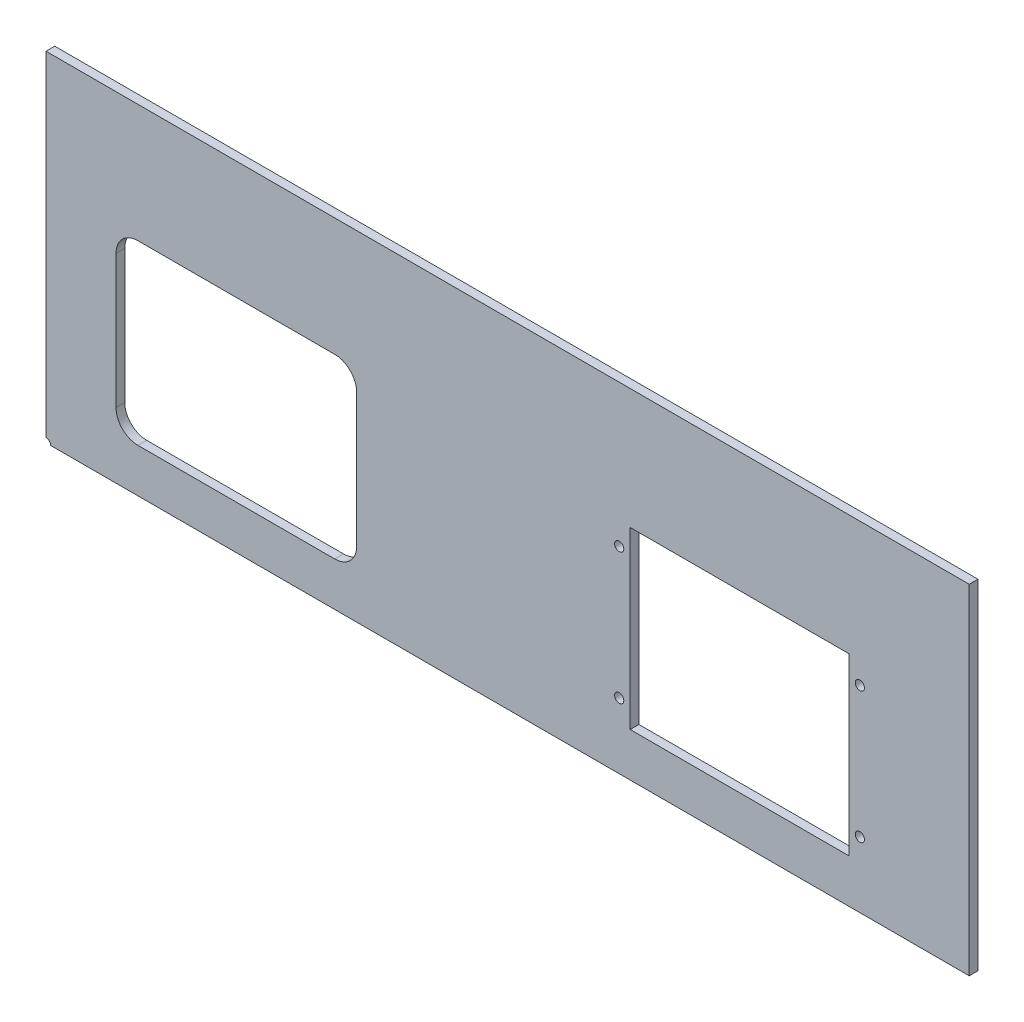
ISO-10303-21;
HEADER;
FILE_DESCRIPTION(('STEP AP214'),'2;1');
FILE_NAME('part.step','',(''),(''),'','','');
FILE_SCHEMA(('AUTOMOTIVE_DESIGN { 1 0 10303 214 1 1 1 1 }'));
ENDSEC;
DATA;
#1=APPLICATION_CONTEXT('core data for automotive mechanical design processes');
#2=APPLICATION_PROTOCOL_DEFINITION('international standard','automotive_design',2000,#1);
#3=PRODUCT_CONTEXT('',#1,'mechanical');
#4=PRODUCT('Part','Part','',(#3));
#5=PRODUCT_RELATED_PRODUCT_CATEGORY('part','',(#4));
#6=PRODUCT_DEFINITION_FORMATION('','',#4);
#7=PRODUCT_DEFINITION_CONTEXT('part definition',#1,'design');
#8=PRODUCT_DEFINITION('design','',#6,#7);
#9=PRODUCT_DEFINITION_SHAPE('','',#8);
#10=(LENGTH_UNIT() NAMED_UNIT(*) SI_UNIT(.MILLI.,.METRE.));
#11=(NAMED_UNIT(*) PLANE_ANGLE_UNIT() SI_UNIT($,.RADIAN.));
#12=(NAMED_UNIT(*) SI_UNIT($,.STERADIAN.) SOLID_ANGLE_UNIT());
#13=UNCERTAINTY_MEASURE_WITH_UNIT(LENGTH_MEASURE(1.E-05),#10,'distance_accuracy_value','');
#14=(GEOMETRIC_REPRESENTATION_CONTEXT(3) GLOBAL_UNCERTAINTY_ASSIGNED_CONTEXT((#13)) GLOBAL_UNIT_ASSIGNED_CONTEXT((#10,
#11,#12)) REPRESENTATION_CONTEXT('',''));
#15=CARTESIAN_POINT('',(0.,0.,0.));
#16=DIRECTION('',(0.,0.,1.));
#17=DIRECTION('',(1.,0.,0.));
#18=AXIS2_PLACEMENT_3D('',#15,#16,#17);
#19=CARTESIAN_POINT('',(0.,0.,4.));
#20=DIRECTION('',(1.,0.,0.));
#21=DIRECTION('',(0.,0.,-1.));
#22=AXIS2_PLACEMENT_3D('',#19,#20,#21);
#23=PLANE('',#22);
#24=DIRECTION('',(0.,-1.,0.));
#25=VECTOR('',#24,1.);
#26=CARTESIAN_POINT('',(0.,0.,0.));
#27=LINE('',#26,#25);
#28=CARTESIAN_POINT('',(0.,155.,0.));
#29=VERTEX_POINT('',#28);
#30=CARTESIAN_POINT('',(0.,2.09999999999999,0.));
#31=VERTEX_POINT('',#30);
#32=EDGE_CURVE('E281',#29,#31,#27,.T.);
#33=ORIENTED_EDGE('',*,*,#32,.T.);
#34=DIRECTION('',(0.,0.,1.));
#35=VECTOR('',#34,1.);
#36=CARTESIAN_POINT('',(0.,2.09999999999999,-128.062484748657));
#37=LINE('',#36,#35);
#38=CARTESIAN_POINT('',(0.,2.09999999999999,4.));
#39=VERTEX_POINT('',#38);
#40=EDGE_CURVE('E218',#31,#39,#37,.T.);
#41=ORIENTED_EDGE('',*,*,#40,.T.);
#42=DIRECTION('',(0.,-1.,0.));
#43=VECTOR('',#42,1.);
#44=CARTESIAN_POINT('',(0.,0.,4.));
#45=LINE('',#44,#43);
#46=CARTESIAN_POINT('',(0.,155.,4.));
#47=VERTEX_POINT('',#46);
#48=EDGE_CURVE('E303',#47,#39,#45,.T.);
#49=ORIENTED_EDGE('',*,*,#48,.F.);
#50=DIRECTION('',(0.,0.,-1.));
#51=VECTOR('',#50,1.);
#52=CARTESIAN_POINT('',(0.,155.,4.));
#53=LINE('',#52,#51);
#54=EDGE_CURVE('E396',#47,#29,#53,.T.);
#55=ORIENTED_EDGE('',*,*,#54,.T.);
#56=EDGE_LOOP('',(#33,#41,#49,#55));
#57=FACE_BOUND('',#56,.T.);
#58=ADVANCED_FACE('F48',(#57),#23,.F.);
#59=CARTESIAN_POINT('',(0.,0.,4.));
#60=DIRECTION('',(0.,1.,0.));
#61=DIRECTION('',(0.,0.,1.));
#62=AXIS2_PLACEMENT_3D('',#59,#60,#61);
#63=PLANE('',#62);
#64=DIRECTION('',(1.,0.,0.));
#65=VECTOR('',#64,1.);
#66=CARTESIAN_POINT('',(0.,0.,4.));
#67=LINE('',#66,#65);
#68=CARTESIAN_POINT('',(2.09999999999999,0.,4.));
#69=VERTEX_POINT('',#68);
#70=CARTESIAN_POINT('',(422.,0.,4.));
#71=VERTEX_POINT('',#70);
#72=EDGE_CURVE('E308',#69,#71,#67,.T.);
#73=ORIENTED_EDGE('',*,*,#72,.F.);
#74=DIRECTION('',(0.,0.,1.));
#75=VECTOR('',#74,1.);
#76=CARTESIAN_POINT('',(2.09999999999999,0.,-128.062484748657));
#77=LINE('',#76,#75);
#78=CARTESIAN_POINT('',(2.09999999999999,0.,0.));
#79=VERTEX_POINT('',#78);
#80=EDGE_CURVE('E214',#69,#79,#77,.F.);
#81=ORIENTED_EDGE('',*,*,#80,.T.);
#82=DIRECTION('',(1.,0.,0.));
#83=VECTOR('',#82,1.);
#84=CARTESIAN_POINT('',(0.,0.,0.));
#85=LINE('',#84,#83);
#86=CARTESIAN_POINT('',(422.,0.,0.));
#87=VERTEX_POINT('',#86);
#88=EDGE_CURVE('E406',#79,#87,#85,.T.);
#89=ORIENTED_EDGE('',*,*,#88,.T.);
#90=DIRECTION('',(0.,0.,-1.));
#91=VECTOR('',#90,1.);
#92=CARTESIAN_POINT('',(422.,0.,4.));
#93=LINE('',#92,#91);
#94=EDGE_CURVE('E12',#71,#87,#93,.T.);
#95=ORIENTED_EDGE('',*,*,#94,.F.);
#96=EDGE_LOOP('',(#73,#81,#89,#95));
#97=FACE_BOUND('',#96,.T.);
#98=ADVANCED_FACE('F427',(#97),#63,.F.);
#99=CARTESIAN_POINT('',(422.,0.,4.));
#100=DIRECTION('',(-1.,0.,0.));
#101=DIRECTION('',(0.,0.,1.));
#102=AXIS2_PLACEMENT_3D('',#99,#100,#101);
#103=PLANE('',#102);
#104=DIRECTION('',(0.,1.,0.));
#105=VECTOR('',#104,1.);
#106=CARTESIAN_POINT('',(422.,0.,0.));
#107=LINE('',#106,#105);
#108=CARTESIAN_POINT('',(422.,155.,0.));
#109=VERTEX_POINT('',#108);
#110=EDGE_CURVE('E674',#87,#109,#107,.T.);
#111=ORIENTED_EDGE('',*,*,#110,.T.);
#112=DIRECTION('',(0.,0.,-1.));
#113=VECTOR('',#112,1.);
#114=CARTESIAN_POINT('',(422.,155.,4.));
#115=LINE('',#114,#113);
#116=CARTESIAN_POINT('',(422.,155.,4.));
#117=VERTEX_POINT('',#116);
#118=EDGE_CURVE('E56',#117,#109,#115,.T.);
#119=ORIENTED_EDGE('',*,*,#118,.F.);
#120=DIRECTION('',(0.,1.,0.));
#121=VECTOR('',#120,1.);
#122=CARTESIAN_POINT('',(422.,0.,4.));
#123=LINE('',#122,#121);
#124=EDGE_CURVE('E681',#71,#117,#123,.T.);
#125=ORIENTED_EDGE('',*,*,#124,.F.);
#126=ORIENTED_EDGE('',*,*,#94,.T.);
#127=EDGE_LOOP('',(#111,#119,#125,#126));
#128=FACE_BOUND('',#127,.T.);
#129=ADVANCED_FACE('F432',(#128),#103,.F.);
#130=CARTESIAN_POINT('',(0.,155.,4.));
#131=DIRECTION('',(0.,-1.,0.));
#132=DIRECTION('',(0.,0.,-1.));
#133=AXIS2_PLACEMENT_3D('',#130,#131,#132);
#134=PLANE('',#133);
#135=DIRECTION('',(-1.,0.,0.));
#136=VECTOR('',#135,1.);
#137=CARTESIAN_POINT('',(0.,155.,0.));
#138=LINE('',#137,#136);
#139=EDGE_CURVE('E309',#109,#29,#138,.T.);
#140=ORIENTED_EDGE('',*,*,#139,.T.);
#141=ORIENTED_EDGE('',*,*,#54,.F.);
#142=DIRECTION('',(-1.,0.,0.));
#143=VECTOR('',#142,1.);
#144=CARTESIAN_POINT('',(0.,155.,4.));
#145=LINE('',#144,#143);
#146=EDGE_CURVE('E391',#117,#47,#145,.T.);
#147=ORIENTED_EDGE('',*,*,#146,.F.);
#148=ORIENTED_EDGE('',*,*,#118,.T.);
#149=EDGE_LOOP('',(#140,#141,#147,#148));
#150=FACE_BOUND('',#149,.T.);
#151=ADVANCED_FACE('F373',(#150),#134,.F.);
#152=CARTESIAN_POINT('',(0.,0.,4.));
#153=DIRECTION('',(0.,0.,-1.));
#154=DIRECTION('',(-1.,0.,0.));
#155=AXIS2_PLACEMENT_3D('',#152,#153,#154);
#156=PLANE('',#155);
#157=CARTESIAN_POINT('',(262.,30.,4.));
#158=DIRECTION('',(0.,0.,1.));
#159=DIRECTION('',(-1.,0.,0.));
#160=AXIS2_PLACEMENT_3D('',#157,#158,#159);
#161=CIRCLE('',#160,2.09999999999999);
#162=CARTESIAN_POINT('',(259.9,30.,4.));
#163=VERTEX_POINT('',#162);
#164=EDGE_CURVE('E355',#163,#163,#161,.T.);
#165=ORIENTED_EDGE('',*,*,#164,.F.);
#166=EDGE_LOOP('',(#165));
#167=FACE_BOUND('',#166,.T.);
#168=CARTESIAN_POINT('',(372.,30.,4.));
#169=DIRECTION('',(0.,0.,1.));
#170=DIRECTION('',(1.,0.,0.));
#171=AXIS2_PLACEMENT_3D('',#168,#169,#170);
#172=CIRCLE('',#171,2.09999999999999);
#173=CARTESIAN_POINT('',(374.1,30.,4.));
#174=VERTEX_POINT('',#173);
#175=EDGE_CURVE('E330',#174,#174,#172,.T.);
#176=ORIENTED_EDGE('',*,*,#175,.F.);
#177=EDGE_LOOP('',(#176));
#178=FACE_BOUND('',#177,.T.);
#179=CARTESIAN_POINT('',(372.,90.,4.));
#180=DIRECTION('',(0.,0.,1.));
#181=DIRECTION('',(1.,0.,0.));
#182=AXIS2_PLACEMENT_3D('',#179,#180,#181);
#183=CIRCLE('',#182,2.09999999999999);
#184=CARTESIAN_POINT('',(374.1,90.,4.));
#185=VERTEX_POINT('',#184);
#186=EDGE_CURVE('E329',#185,#185,#183,.T.);
#187=ORIENTED_EDGE('',*,*,#186,.F.);
#188=EDGE_LOOP('',(#187));
#189=FACE_BOUND('',#188,.T.);
#190=CARTESIAN_POINT('',(262.,90.,4.));
#191=DIRECTION('',(0.,0.,1.));
#192=DIRECTION('',(-1.,0.,0.));
#193=AXIS2_PLACEMENT_3D('',#190,#191,#192);
#194=CIRCLE('',#193,2.09999999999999);
#195=CARTESIAN_POINT('',(259.9,90.,4.));
#196=VERTEX_POINT('',#195);
#197=EDGE_CURVE('E344',#196,#196,#194,.T.);
#198=ORIENTED_EDGE('',*,*,#197,.F.);
#199=EDGE_LOOP('',(#198));
#200=FACE_BOUND('',#199,.T.);
#201=DIRECTION('',(0.,-1.,0.));
#202=VECTOR('',#201,1.);
#203=CARTESIAN_POINT('',(267.,20.,4.));
#204=LINE('',#203,#202);
#205=CARTESIAN_POINT('',(267.,100.,4.));
#206=VERTEX_POINT('',#205);
#207=CARTESIAN_POINT('',(267.,20.,4.));
#208=VERTEX_POINT('',#207);
#209=EDGE_CURVE('E195',#206,#208,#204,.T.);
#210=ORIENTED_EDGE('',*,*,#209,.F.);
#211=DIRECTION('',(-1.,0.,0.));
#212=VECTOR('',#211,1.);
#213=CARTESIAN_POINT('',(367.,100.,4.));
#214=LINE('',#213,#212);
#215=CARTESIAN_POINT('',(367.,100.,4.));
#216=VERTEX_POINT('',#215);
#217=EDGE_CURVE('E185',#216,#206,#214,.T.);
#218=ORIENTED_EDGE('',*,*,#217,.F.);
#219=DIRECTION('',(0.,1.,0.));
#220=VECTOR('',#219,1.);
#221=CARTESIAN_POINT('',(367.,20.,4.));
#222=LINE('',#221,#220);
#223=CARTESIAN_POINT('',(367.,20.,4.));
#224=VERTEX_POINT('',#223);
#225=EDGE_CURVE('E199',#224,#216,#222,.T.);
#226=ORIENTED_EDGE('',*,*,#225,.F.);
#227=DIRECTION('',(1.,0.,0.));
#228=VECTOR('',#227,1.);
#229=CARTESIAN_POINT('',(367.,20.,4.));
#230=LINE('',#229,#228);
#231=EDGE_CURVE('E63',#208,#224,#230,.T.);
#232=ORIENTED_EDGE('',*,*,#231,.F.);
#233=EDGE_LOOP('',(#210,#218,#226,#232));
#234=FACE_BOUND('',#233,.T.);
#235=DIRECTION('',(0.,-1.,0.));
#236=VECTOR('',#235,1.);
#237=CARTESIAN_POINT('',(32.,91.,4.));
#238=LINE('',#237,#236);
#239=CARTESIAN_POINT('',(32.,91.,4.));
#240=VERTEX_POINT('',#239);
#241=CARTESIAN_POINT('',(32.,30.,4.));
#242=VERTEX_POINT('',#241);
#243=EDGE_CURVE('E260',#240,#242,#238,.T.);
#244=ORIENTED_EDGE('',*,*,#243,.F.);
#245=CARTESIAN_POINT('',(42.,91.,4.));
#246=DIRECTION('',(0.,0.,1.));
#247=DIRECTION('',(1.,0.,0.));
#248=AXIS2_PLACEMENT_3D('',#245,#246,#247);
#249=CIRCLE('',#248,10.);
#250=CARTESIAN_POINT('',(42.,101.,4.));
#251=VERTEX_POINT('',#250);
#252=EDGE_CURVE('E222',#251,#240,#249,.T.);
#253=ORIENTED_EDGE('',*,*,#252,.F.);
#254=DIRECTION('',(-1.,0.,0.));
#255=VECTOR('',#254,1.);
#256=CARTESIAN_POINT('',(42.,101.,4.));
#257=LINE('',#256,#255);
#258=CARTESIAN_POINT('',(132.,101.,4.));
#259=VERTEX_POINT('',#258);
#260=EDGE_CURVE('E228',#259,#251,#257,.T.);
#261=ORIENTED_EDGE('',*,*,#260,.F.);
#262=CARTESIAN_POINT('',(132.,91.,4.));
#263=DIRECTION('',(0.,0.,1.));
#264=DIRECTION('',(1.,0.,0.));
#265=AXIS2_PLACEMENT_3D('',#262,#263,#264);
#266=CIRCLE('',#265,10.);
#267=CARTESIAN_POINT('',(142.,91.,4.));
#268=VERTEX_POINT('',#267);
#269=EDGE_CURVE('E275',#268,#259,#266,.T.);
#270=ORIENTED_EDGE('',*,*,#269,.F.);
#271=DIRECTION('',(0.,1.,0.));
#272=VECTOR('',#271,1.);
#273=CARTESIAN_POINT('',(142.,91.,4.));
#274=LINE('',#273,#272);
#275=CARTESIAN_POINT('',(142.,30.,4.));
#276=VERTEX_POINT('',#275);
#277=EDGE_CURVE('E647',#276,#268,#274,.T.);
#278=ORIENTED_EDGE('',*,*,#277,.F.);
#279=CARTESIAN_POINT('',(132.,30.,4.));
#280=DIRECTION('',(0.,0.,1.));
#281=DIRECTION('',(-1.,0.,0.));
#282=AXIS2_PLACEMENT_3D('',#279,#280,#281);
#283=CIRCLE('',#282,10.);
#284=CARTESIAN_POINT('',(132.,20.,4.));
#285=VERTEX_POINT('',#284);
#286=EDGE_CURVE('E649',#285,#276,#283,.T.);
#287=ORIENTED_EDGE('',*,*,#286,.F.);
#288=DIRECTION('',(1.,0.,0.));
#289=VECTOR('',#288,1.);
#290=CARTESIAN_POINT('',(42.,20.,4.));
#291=LINE('',#290,#289);
#292=CARTESIAN_POINT('',(42.,20.,4.));
#293=VERTEX_POINT('',#292);
#294=EDGE_CURVE('E652',#293,#285,#291,.T.);
#295=ORIENTED_EDGE('',*,*,#294,.F.);
#296=CARTESIAN_POINT('',(42.,30.,4.));
#297=DIRECTION('',(0.,0.,1.));
#298=DIRECTION('',(-1.,0.,0.));
#299=AXIS2_PLACEMENT_3D('',#296,#297,#298);
#300=CIRCLE('',#299,10.);
#301=EDGE_CURVE('E661',#242,#293,#300,.T.);
#302=ORIENTED_EDGE('',*,*,#301,.F.);
#303=EDGE_LOOP('',(#244,#253,#261,#270,#278,#287,#295,#302));
#304=FACE_BOUND('',#303,.T.);
#305=ORIENTED_EDGE('',*,*,#48,.T.);
#306=CARTESIAN_POINT('',(0.,0.,4.));
#307=DIRECTION('',(0.,0.,1.));
#308=DIRECTION('',(1.,0.,0.));
#309=AXIS2_PLACEMENT_3D('',#306,#307,#308);
#310=CIRCLE('',#309,2.09999999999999);
#311=EDGE_CURVE('E318',#69,#39,#310,.T.);
#312=ORIENTED_EDGE('',*,*,#311,.F.);
#313=ORIENTED_EDGE('',*,*,#72,.T.);
#314=ORIENTED_EDGE('',*,*,#124,.T.);
#315=ORIENTED_EDGE('',*,*,#146,.T.);
#316=EDGE_LOOP('',(#305,#312,#313,#314,#315));
#317=FACE_BOUND('',#316,.T.);
#318=ADVANCED_FACE('F370',(#167,#178,#189,#200,#234,#304,#317),#156,.F.);
#319=CARTESIAN_POINT('',(0.,0.,0.));
#320=DIRECTION('',(0.,0.,-1.));
#321=DIRECTION('',(-1.,0.,0.));
#322=AXIS2_PLACEMENT_3D('',#319,#320,#321);
#323=PLANE('',#322);
#324=CARTESIAN_POINT('',(262.,30.,0.));
#325=DIRECTION('',(0.,0.,-1.));
#326=DIRECTION('',(-1.,0.,0.));
#327=AXIS2_PLACEMENT_3D('',#324,#325,#326);
#328=CIRCLE('',#327,2.09999999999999);
#329=CARTESIAN_POINT('',(259.9,30.,0.));
#330=VERTEX_POINT('',#329);
#331=EDGE_CURVE('E350',#330,#330,#328,.F.);
#332=ORIENTED_EDGE('',*,*,#331,.T.);
#333=EDGE_LOOP('',(#332));
#334=FACE_BOUND('',#333,.T.);
#335=CARTESIAN_POINT('',(372.,30.,0.));
#336=DIRECTION('',(0.,0.,-1.));
#337=DIRECTION('',(-1.,0.,0.));
#338=AXIS2_PLACEMENT_3D('',#335,#336,#337);
#339=CIRCLE('',#338,2.09999999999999);
#340=CARTESIAN_POINT('',(369.9,30.,0.));
#341=VERTEX_POINT('',#340);
#342=EDGE_CURVE('E352',#341,#341,#339,.F.);
#343=ORIENTED_EDGE('',*,*,#342,.T.);
#344=EDGE_LOOP('',(#343));
#345=FACE_BOUND('',#344,.T.);
#346=CARTESIAN_POINT('',(372.,90.,0.));
#347=DIRECTION('',(0.,0.,-1.));
#348=DIRECTION('',(-1.,0.,0.));
#349=AXIS2_PLACEMENT_3D('',#346,#347,#348);
#350=CIRCLE('',#349,2.09999999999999);
#351=CARTESIAN_POINT('',(369.9,90.,0.));
#352=VERTEX_POINT('',#351);
#353=EDGE_CURVE('E325',#352,#352,#350,.F.);
#354=ORIENTED_EDGE('',*,*,#353,.T.);
#355=EDGE_LOOP('',(#354));
#356=FACE_BOUND('',#355,.T.);
#357=CARTESIAN_POINT('',(0.,0.,0.));
#358=DIRECTION('',(0.,0.,-1.));
#359=DIRECTION('',(-1.,0.,0.));
#360=AXIS2_PLACEMENT_3D('',#357,#358,#359);
#361=CIRCLE('',#360,2.09999999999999);
#362=EDGE_CURVE('E323',#79,#31,#361,.F.);
#363=ORIENTED_EDGE('',*,*,#362,.T.);
#364=ORIENTED_EDGE('',*,*,#32,.F.);
#365=ORIENTED_EDGE('',*,*,#139,.F.);
#366=ORIENTED_EDGE('',*,*,#110,.F.);
#367=ORIENTED_EDGE('',*,*,#88,.F.);
#368=EDGE_LOOP('',(#363,#364,#365,#366,#367));
#369=FACE_BOUND('',#368,.T.);
#370=CARTESIAN_POINT('',(262.,90.,0.));
#371=DIRECTION('',(0.,0.,-1.));
#372=DIRECTION('',(-1.,0.,0.));
#373=AXIS2_PLACEMENT_3D('',#370,#371,#372);
#374=CIRCLE('',#373,2.09999999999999);
#375=CARTESIAN_POINT('',(259.9,90.,0.));
#376=VERTEX_POINT('',#375);
#377=EDGE_CURVE('E351',#376,#376,#374,.F.);
#378=ORIENTED_EDGE('',*,*,#377,.T.);
#379=EDGE_LOOP('',(#378));
#380=FACE_BOUND('',#379,.T.);
#381=DIRECTION('',(-1.,0.,0.));
#382=VECTOR('',#381,1.);
#383=CARTESIAN_POINT('',(367.,100.,0.));
#384=LINE('',#383,#382);
#385=CARTESIAN_POINT('',(367.,100.,0.));
#386=VERTEX_POINT('',#385);
#387=CARTESIAN_POINT('',(267.,100.,0.));
#388=VERTEX_POINT('',#387);
#389=EDGE_CURVE('E182',#386,#388,#384,.T.);
#390=ORIENTED_EDGE('',*,*,#389,.T.);
#391=DIRECTION('',(0.,-1.,0.));
#392=VECTOR('',#391,1.);
#393=CARTESIAN_POINT('',(267.,20.,0.));
#394=LINE('',#393,#392);
#395=CARTESIAN_POINT('',(267.,20.,0.));
#396=VERTEX_POINT('',#395);
#397=EDGE_CURVE('E168',#388,#396,#394,.T.);
#398=ORIENTED_EDGE('',*,*,#397,.T.);
#399=DIRECTION('',(1.,0.,0.));
#400=VECTOR('',#399,1.);
#401=CARTESIAN_POINT('',(367.,20.,0.));
#402=LINE('',#401,#400);
#403=CARTESIAN_POINT('',(367.,20.,0.));
#404=VERTEX_POINT('',#403);
#405=EDGE_CURVE('E205',#396,#404,#402,.T.);
#406=ORIENTED_EDGE('',*,*,#405,.T.);
#407=DIRECTION('',(0.,1.,0.));
#408=VECTOR('',#407,1.);
#409=CARTESIAN_POINT('',(367.,20.,0.));
#410=LINE('',#409,#408);
#411=EDGE_CURVE('E191',#404,#386,#410,.T.);
#412=ORIENTED_EDGE('',*,*,#411,.T.);
#413=EDGE_LOOP('',(#390,#398,#406,#412));
#414=FACE_BOUND('',#413,.T.);
#415=CARTESIAN_POINT('',(42.,91.,0.));
#416=DIRECTION('',(0.,0.,1.));
#417=DIRECTION('',(1.,0.,0.));
#418=AXIS2_PLACEMENT_3D('',#415,#416,#417);
#419=CIRCLE('',#418,10.);
#420=CARTESIAN_POINT('',(42.,101.,0.));
#421=VERTEX_POINT('',#420);
#422=CARTESIAN_POINT('',(32.,91.,0.));
#423=VERTEX_POINT('',#422);
#424=EDGE_CURVE('E223',#421,#423,#419,.T.);
#425=ORIENTED_EDGE('',*,*,#424,.T.);
#426=DIRECTION('',(0.,-1.,0.));
#427=VECTOR('',#426,1.);
#428=CARTESIAN_POINT('',(32.,91.,0.));
#429=LINE('',#428,#427);
#430=CARTESIAN_POINT('',(32.,30.,0.));
#431=VERTEX_POINT('',#430);
#432=EDGE_CURVE('E227',#423,#431,#429,.T.);
#433=ORIENTED_EDGE('',*,*,#432,.T.);
#434=CARTESIAN_POINT('',(42.,30.,0.));
#435=DIRECTION('',(0.,0.,1.));
#436=DIRECTION('',(-1.,0.,0.));
#437=AXIS2_PLACEMENT_3D('',#434,#435,#436);
#438=CIRCLE('',#437,10.);
#439=CARTESIAN_POINT('',(42.,20.,0.));
#440=VERTEX_POINT('',#439);
#441=EDGE_CURVE('E232',#431,#440,#438,.T.);
#442=ORIENTED_EDGE('',*,*,#441,.T.);
#443=DIRECTION('',(1.,0.,0.));
#444=VECTOR('',#443,1.);
#445=CARTESIAN_POINT('',(42.,20.,0.));
#446=LINE('',#445,#444);
#447=CARTESIAN_POINT('',(132.,20.,0.));
#448=VERTEX_POINT('',#447);
#449=EDGE_CURVE('E236',#440,#448,#446,.T.);
#450=ORIENTED_EDGE('',*,*,#449,.T.);
#451=CARTESIAN_POINT('',(132.,30.,0.));
#452=DIRECTION('',(0.,0.,1.));
#453=DIRECTION('',(-1.,0.,0.));
#454=AXIS2_PLACEMENT_3D('',#451,#452,#453);
#455=CIRCLE('',#454,10.);
#456=CARTESIAN_POINT('',(142.,30.,0.));
#457=VERTEX_POINT('',#456);
#458=EDGE_CURVE('E240',#448,#457,#455,.T.);
#459=ORIENTED_EDGE('',*,*,#458,.T.);
#460=DIRECTION('',(0.,1.,0.));
#461=VECTOR('',#460,1.);
#462=CARTESIAN_POINT('',(142.,91.,0.));
#463=LINE('',#462,#461);
#464=CARTESIAN_POINT('',(142.,91.,0.));
#465=VERTEX_POINT('',#464);
#466=EDGE_CURVE('E244',#457,#465,#463,.T.);
#467=ORIENTED_EDGE('',*,*,#466,.T.);
#468=CARTESIAN_POINT('',(132.,91.,0.));
#469=DIRECTION('',(0.,0.,1.));
#470=DIRECTION('',(1.,0.,0.));
#471=AXIS2_PLACEMENT_3D('',#468,#469,#470);
#472=CIRCLE('',#471,10.);
#473=CARTESIAN_POINT('',(132.,101.,0.));
#474=VERTEX_POINT('',#473);
#475=EDGE_CURVE('E248',#465,#474,#472,.T.);
#476=ORIENTED_EDGE('',*,*,#475,.T.);
#477=DIRECTION('',(-1.,0.,0.));
#478=VECTOR('',#477,1.);
#479=CARTESIAN_POINT('',(42.,101.,0.));
#480=LINE('',#479,#478);
#481=EDGE_CURVE('E252',#474,#421,#480,.T.);
#482=ORIENTED_EDGE('',*,*,#481,.T.);
#483=EDGE_LOOP('',(#425,#433,#442,#450,#459,#467,#476,#482));
#484=FACE_BOUND('',#483,.T.);
#485=ADVANCED_FACE('F189',(#334,#345,#356,#369,#380,#414,#484),#323,.T.);
#486=CARTESIAN_POINT('',(42.,91.,0.));
#487=DIRECTION('',(0.,0.,1.));
#488=DIRECTION('',(1.,0.,0.));
#489=AXIS2_PLACEMENT_3D('',#486,#487,#488);
#490=CYLINDRICAL_SURFACE('',#489,10.);
#491=ORIENTED_EDGE('',*,*,#252,.T.);
#492=DIRECTION('',(0.,0.,1.));
#493=VECTOR('',#492,1.);
#494=CARTESIAN_POINT('',(32.,91.,0.));
#495=LINE('',#494,#493);
#496=EDGE_CURVE('E256',#423,#240,#495,.T.);
#497=ORIENTED_EDGE('',*,*,#496,.F.);
#498=ORIENTED_EDGE('',*,*,#424,.F.);
#499=DIRECTION('',(0.,0.,1.));
#500=VECTOR('',#499,1.);
#501=CARTESIAN_POINT('',(42.,101.,0.));
#502=LINE('',#501,#500);
#503=EDGE_CURVE('E278',#421,#251,#502,.T.);
#504=ORIENTED_EDGE('',*,*,#503,.T.);
#505=EDGE_LOOP('',(#491,#497,#498,#504));
#506=FACE_BOUND('',#505,.T.);
#507=ADVANCED_FACE('F444',(#506),#490,.F.);
#508=CARTESIAN_POINT('',(42.,101.,0.));
#509=DIRECTION('',(0.,1.,0.));
#510=DIRECTION('',(0.,0.,1.));
#511=AXIS2_PLACEMENT_3D('',#508,#509,#510);
#512=PLANE('',#511);
#513=ORIENTED_EDGE('',*,*,#260,.T.);
#514=ORIENTED_EDGE('',*,*,#503,.F.);
#515=ORIENTED_EDGE('',*,*,#481,.F.);
#516=DIRECTION('',(0.,0.,1.));
#517=VECTOR('',#516,1.);
#518=CARTESIAN_POINT('',(132.,101.,0.));
#519=LINE('',#518,#517);
#520=EDGE_CURVE('E282',#474,#259,#519,.T.);
#521=ORIENTED_EDGE('',*,*,#520,.T.);
#522=EDGE_LOOP('',(#513,#514,#515,#521));
#523=FACE_BOUND('',#522,.T.);
#524=ADVANCED_FACE('F449',(#523),#512,.F.);
#525=CARTESIAN_POINT('',(132.,91.,0.));
#526=DIRECTION('',(0.,0.,1.));
#527=DIRECTION('',(1.,0.,0.));
#528=AXIS2_PLACEMENT_3D('',#525,#526,#527);
#529=CYLINDRICAL_SURFACE('',#528,10.);
#530=ORIENTED_EDGE('',*,*,#269,.T.);
#531=ORIENTED_EDGE('',*,*,#520,.F.);
#532=ORIENTED_EDGE('',*,*,#475,.F.);
#533=DIRECTION('',(0.,0.,1.));
#534=VECTOR('',#533,1.);
#535=CARTESIAN_POINT('',(142.,91.,0.));
#536=LINE('',#535,#534);
#537=EDGE_CURVE('E285',#465,#268,#536,.T.);
#538=ORIENTED_EDGE('',*,*,#537,.T.);
#539=EDGE_LOOP('',(#530,#531,#532,#538));
#540=FACE_BOUND('',#539,.T.);
#541=ADVANCED_FACE('F469',(#540),#529,.F.);
#542=CARTESIAN_POINT('',(142.,91.,0.));
#543=DIRECTION('',(1.,0.,0.));
#544=DIRECTION('',(0.,0.,-1.));
#545=AXIS2_PLACEMENT_3D('',#542,#543,#544);
#546=PLANE('',#545);
#547=ORIENTED_EDGE('',*,*,#277,.T.);
#548=ORIENTED_EDGE('',*,*,#537,.F.);
#549=ORIENTED_EDGE('',*,*,#466,.F.);
#550=DIRECTION('',(0.,0.,1.));
#551=VECTOR('',#550,1.);
#552=CARTESIAN_POINT('',(142.,30.,0.));
#553=LINE('',#552,#551);
#554=EDGE_CURVE('E288',#457,#276,#553,.T.);
#555=ORIENTED_EDGE('',*,*,#554,.T.);
#556=EDGE_LOOP('',(#547,#548,#549,#555));
#557=FACE_BOUND('',#556,.T.);
#558=ADVANCED_FACE('F465',(#557),#546,.F.);
#559=CARTESIAN_POINT('',(132.,30.,0.));
#560=DIRECTION('',(0.,0.,1.));
#561=DIRECTION('',(1.,0.,0.));
#562=AXIS2_PLACEMENT_3D('',#559,#560,#561);
#563=CYLINDRICAL_SURFACE('',#562,10.);
#564=ORIENTED_EDGE('',*,*,#286,.T.);
#565=ORIENTED_EDGE('',*,*,#554,.F.);
#566=ORIENTED_EDGE('',*,*,#458,.F.);
#567=DIRECTION('',(0.,0.,1.));
#568=VECTOR('',#567,1.);
#569=CARTESIAN_POINT('',(132.,20.,0.));
#570=LINE('',#569,#568);
#571=EDGE_CURVE('E291',#448,#285,#570,.T.);
#572=ORIENTED_EDGE('',*,*,#571,.T.);
#573=EDGE_LOOP('',(#564,#565,#566,#572));
#574=FACE_BOUND('',#573,.T.);
#575=ADVANCED_FACE('F461',(#574),#563,.F.);
#576=CARTESIAN_POINT('',(42.,20.,0.));
#577=DIRECTION('',(0.,-1.,0.));
#578=DIRECTION('',(0.,0.,-1.));
#579=AXIS2_PLACEMENT_3D('',#576,#577,#578);
#580=PLANE('',#579);
#581=ORIENTED_EDGE('',*,*,#294,.T.);
#582=ORIENTED_EDGE('',*,*,#571,.F.);
#583=ORIENTED_EDGE('',*,*,#449,.F.);
#584=DIRECTION('',(0.,0.,1.));
#585=VECTOR('',#584,1.);
#586=CARTESIAN_POINT('',(42.,20.,0.));
#587=LINE('',#586,#585);
#588=EDGE_CURVE('E294',#440,#293,#587,.T.);
#589=ORIENTED_EDGE('',*,*,#588,.T.);
#590=EDGE_LOOP('',(#581,#582,#583,#589));
#591=FACE_BOUND('',#590,.T.);
#592=ADVANCED_FACE('F457',(#591),#580,.F.);
#593=CARTESIAN_POINT('',(42.,30.,0.));
#594=DIRECTION('',(0.,0.,1.));
#595=DIRECTION('',(1.,0.,0.));
#596=AXIS2_PLACEMENT_3D('',#593,#594,#595);
#597=CYLINDRICAL_SURFACE('',#596,10.);
#598=ORIENTED_EDGE('',*,*,#301,.T.);
#599=ORIENTED_EDGE('',*,*,#588,.F.);
#600=ORIENTED_EDGE('',*,*,#441,.F.);
#601=DIRECTION('',(0.,0.,1.));
#602=VECTOR('',#601,1.);
#603=CARTESIAN_POINT('',(32.,30.,0.));
#604=LINE('',#603,#602);
#605=EDGE_CURVE('E297',#431,#242,#604,.T.);
#606=ORIENTED_EDGE('',*,*,#605,.T.);
#607=EDGE_LOOP('',(#598,#599,#600,#606));
#608=FACE_BOUND('',#607,.T.);
#609=ADVANCED_FACE('F453',(#608),#597,.F.);
#610=CARTESIAN_POINT('',(32.,91.,0.));
#611=DIRECTION('',(-1.,0.,0.));
#612=DIRECTION('',(0.,-1.,0.));
#613=AXIS2_PLACEMENT_3D('',#610,#611,#612);
#614=PLANE('',#613);
#615=ORIENTED_EDGE('',*,*,#243,.T.);
#616=ORIENTED_EDGE('',*,*,#605,.F.);
#617=ORIENTED_EDGE('',*,*,#432,.F.);
#618=ORIENTED_EDGE('',*,*,#496,.T.);
#619=EDGE_LOOP('',(#615,#616,#617,#618));
#620=FACE_BOUND('',#619,.T.);
#621=ADVANCED_FACE('F451',(#620),#614,.F.);
#622=CARTESIAN_POINT('',(367.,100.,-128.062484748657));
#623=DIRECTION('',(0.,1.,0.));
#624=DIRECTION('',(-1.,0.,0.));
#625=AXIS2_PLACEMENT_3D('',#622,#623,#624);
#626=PLANE('',#625);
#627=DIRECTION('',(0.,0.,1.));
#628=VECTOR('',#627,1.);
#629=CARTESIAN_POINT('',(367.,100.,-128.062484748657));
#630=LINE('',#629,#628);
#631=EDGE_CURVE('E71',#386,#216,#630,.T.);
#632=ORIENTED_EDGE('',*,*,#631,.T.);
#633=ORIENTED_EDGE('',*,*,#217,.T.);
#634=DIRECTION('',(0.,0.,1.));
#635=VECTOR('',#634,1.);
#636=CARTESIAN_POINT('',(267.,100.,-128.062484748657));
#637=LINE('',#636,#635);
#638=EDGE_CURVE('E172',#388,#206,#637,.T.);
#639=ORIENTED_EDGE('',*,*,#638,.F.);
#640=ORIENTED_EDGE('',*,*,#389,.F.);
#641=EDGE_LOOP('',(#632,#633,#639,#640));
#642=FACE_BOUND('',#641,.T.);
#643=ADVANCED_FACE('F181',(#642),#626,.F.);
#644=CARTESIAN_POINT('',(267.,20.,-128.062484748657));
#645=DIRECTION('',(-1.,0.,0.));
#646=DIRECTION('',(0.,0.,1.));
#647=AXIS2_PLACEMENT_3D('',#644,#645,#646);
#648=PLANE('',#647);
#649=ORIENTED_EDGE('',*,*,#638,.T.);
#650=ORIENTED_EDGE('',*,*,#209,.T.);
#651=DIRECTION('',(0.,0.,1.));
#652=VECTOR('',#651,1.);
#653=CARTESIAN_POINT('',(267.,20.,-128.062484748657));
#654=LINE('',#653,#652);
#655=EDGE_CURVE('E174',#396,#208,#654,.T.);
#656=ORIENTED_EDGE('',*,*,#655,.F.);
#657=ORIENTED_EDGE('',*,*,#397,.F.);
#658=EDGE_LOOP('',(#649,#650,#656,#657));
#659=FACE_BOUND('',#658,.T.);
#660=ADVANCED_FACE('F170',(#659),#648,.F.);
#661=CARTESIAN_POINT('',(367.,20.,-128.062484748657));
#662=DIRECTION('',(0.,-1.,0.));
#663=DIRECTION('',(1.,0.,0.));
#664=AXIS2_PLACEMENT_3D('',#661,#662,#663);
#665=PLANE('',#664);
#666=ORIENTED_EDGE('',*,*,#655,.T.);
#667=ORIENTED_EDGE('',*,*,#231,.T.);
#668=DIRECTION('',(0.,0.,1.));
#669=VECTOR('',#668,1.);
#670=CARTESIAN_POINT('',(367.,20.,-128.062484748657));
#671=LINE('',#670,#669);
#672=EDGE_CURVE('E204',#404,#224,#671,.T.);
#673=ORIENTED_EDGE('',*,*,#672,.F.);
#674=ORIENTED_EDGE('',*,*,#405,.F.);
#675=EDGE_LOOP('',(#666,#667,#673,#674));
#676=FACE_BOUND('',#675,.T.);
#677=ADVANCED_FACE('F416',(#676),#665,.F.);
#678=CARTESIAN_POINT('',(367.,20.,-128.062484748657));
#679=DIRECTION('',(1.,0.,0.));
#680=DIRECTION('',(0.,0.,-1.));
#681=AXIS2_PLACEMENT_3D('',#678,#679,#680);
#682=PLANE('',#681);
#683=ORIENTED_EDGE('',*,*,#672,.T.);
#684=ORIENTED_EDGE('',*,*,#225,.T.);
#685=ORIENTED_EDGE('',*,*,#631,.F.);
#686=ORIENTED_EDGE('',*,*,#411,.F.);
#687=EDGE_LOOP('',(#683,#684,#685,#686));
#688=FACE_BOUND('',#687,.T.);
#689=ADVANCED_FACE('F415',(#688),#682,.F.);
#690=CARTESIAN_POINT('',(262.,90.,-128.062484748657));
#691=DIRECTION('',(0.,0.,1.));
#692=DIRECTION('',(1.,0.,0.));
#693=AXIS2_PLACEMENT_3D('',#690,#691,#692);
#694=CYLINDRICAL_SURFACE('',#693,2.09999999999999);
#695=ORIENTED_EDGE('',*,*,#197,.T.);
#696=EDGE_LOOP('',(#695));
#697=FACE_BOUND('',#696,.T.);
#698=ORIENTED_EDGE('',*,*,#377,.F.);
#699=EDGE_LOOP('',(#698));
#700=FACE_BOUND('',#699,.T.);
#701=ADVANCED_FACE('F423',(#697,#700),#694,.F.);
#702=CARTESIAN_POINT('',(0.,0.,-128.062484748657));
#703=DIRECTION('',(0.,0.,1.));
#704=DIRECTION('',(1.,0.,0.));
#705=AXIS2_PLACEMENT_3D('',#702,#703,#704);
#706=CYLINDRICAL_SURFACE('',#705,2.09999999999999);
#707=ORIENTED_EDGE('',*,*,#362,.F.);
#708=ORIENTED_EDGE('',*,*,#80,.F.);
#709=ORIENTED_EDGE('',*,*,#311,.T.);
#710=ORIENTED_EDGE('',*,*,#40,.F.);
#711=EDGE_LOOP('',(#707,#708,#709,#710));
#712=FACE_BOUND('',#711,.T.);
#713=ADVANCED_FACE('F400',(#712),#706,.F.);
#714=CARTESIAN_POINT('',(372.,90.,-128.062484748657));
#715=DIRECTION('',(0.,0.,1.));
#716=DIRECTION('',(1.,0.,0.));
#717=AXIS2_PLACEMENT_3D('',#714,#715,#716);
#718=CYLINDRICAL_SURFACE('',#717,2.09999999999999);
#719=ORIENTED_EDGE('',*,*,#186,.T.);
#720=EDGE_LOOP('',(#719));
#721=FACE_BOUND('',#720,.T.);
#722=ORIENTED_EDGE('',*,*,#353,.F.);
#723=EDGE_LOOP('',(#722));
#724=FACE_BOUND('',#723,.T.);
#725=ADVANCED_FACE('F517',(#721,#724),#718,.F.);
#726=CARTESIAN_POINT('',(372.,30.,-128.062484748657));
#727=DIRECTION('',(0.,0.,1.));
#728=DIRECTION('',(1.,0.,0.));
#729=AXIS2_PLACEMENT_3D('',#726,#727,#728);
#730=CYLINDRICAL_SURFACE('',#729,2.09999999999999);
#731=ORIENTED_EDGE('',*,*,#175,.T.);
#732=EDGE_LOOP('',(#731));
#733=FACE_BOUND('',#732,.T.);
#734=ORIENTED_EDGE('',*,*,#342,.F.);
#735=EDGE_LOOP('',(#734));
#736=FACE_BOUND('',#735,.T.);
#737=ADVANCED_FACE('F526',(#733,#736),#730,.F.);
#738=CARTESIAN_POINT('',(262.,30.,-128.062484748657));
#739=DIRECTION('',(0.,0.,1.));
#740=DIRECTION('',(1.,0.,0.));
#741=AXIS2_PLACEMENT_3D('',#738,#739,#740);
#742=CYLINDRICAL_SURFACE('',#741,2.09999999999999);
#743=ORIENTED_EDGE('',*,*,#164,.T.);
#744=EDGE_LOOP('',(#743));
#745=FACE_BOUND('',#744,.T.);
#746=ORIENTED_EDGE('',*,*,#331,.F.);
#747=EDGE_LOOP('',(#746));
#748=FACE_BOUND('',#747,.T.);
#749=ADVANCED_FACE('F367',(#745,#748),#742,.F.);
#750=CLOSED_SHELL('',(#58,#98,#129,#151,#318,#485,#507,#524,#541,#558,#575,#592,#609,#621,#643,
#660,#677,#689,#701,#713,#725,#737,#749));
#751=MANIFOLD_SOLID_BREP('B2',#750);
#752=ADVANCED_BREP_SHAPE_REPRESENTATION('',(#18,#751),#14);
#753=SHAPE_DEFINITION_REPRESENTATION(#9,#752);
ENDSEC;
END-ISO-10303-21;
